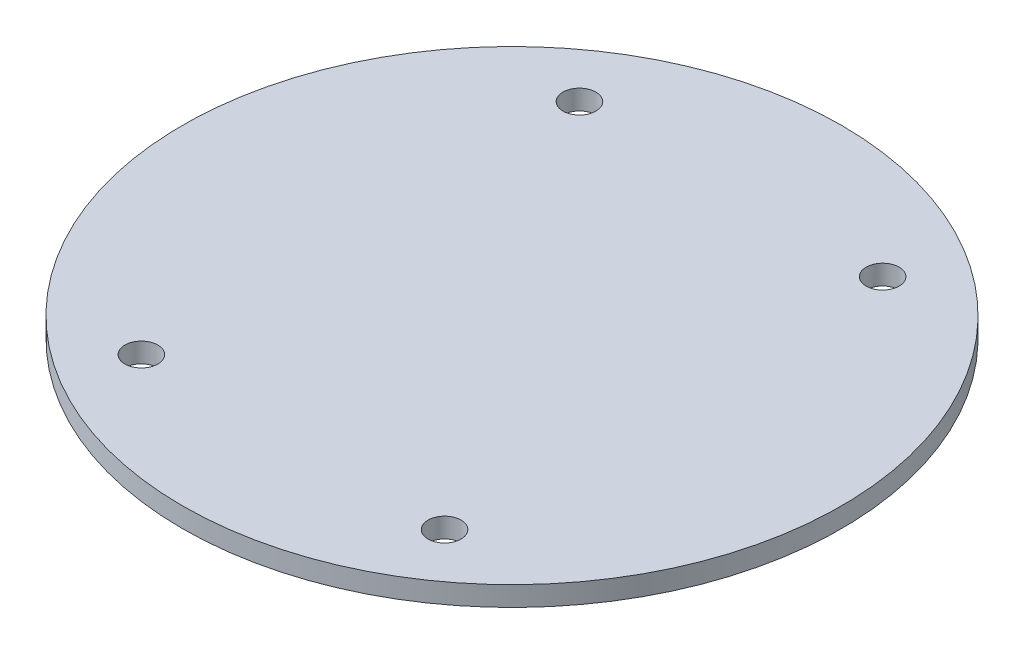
from build123d import *

# Parameters (mm, degrees)
SKETCH1_R      = 50
BASE_DEPTH     = 3
SKETCH2_R      = 2.5
SUPPORTS_DEPTH = 71.774289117


with BuildPart() as part:
    # Sketch1 → Base (new body)
    with BuildSketch(Plane(origin=(0, 0, 0), x_dir=(1, 0, 0), z_dir=(0, 1, 0))):
        with Locations(Location((0, 0, 0), (0, 0, 270))):
            Circle(SKETCH1_R)
    extrude(amount=BASE_DEPTH)

    # Sketch2 → Supports (cut, through all)
    with BuildSketch(Plane(origin=(0, 3, 0), x_dir=(1, 0, 0), z_dir=(0, 1, 0))):
        with Locations(Location((-23, 33.234018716, 0), (0, 0, 270))):
            Circle(SKETCH2_R)
        with Locations(Location((23, 33.234018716, 0), (0, 0, 90))):
            Circle(SKETCH2_R)
        with Locations(Location((23, -33.234018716, 0), (0, 0, 270))):
            Circle(SKETCH2_R)
        with Locations(Location((-23, -33.234018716, 0), (0, 0, 90))):
            Circle(SKETCH2_R)
    extrude(amount=-SUPPORTS_DEPTH, mode=Mode.SUBTRACT)


solid = part.part
